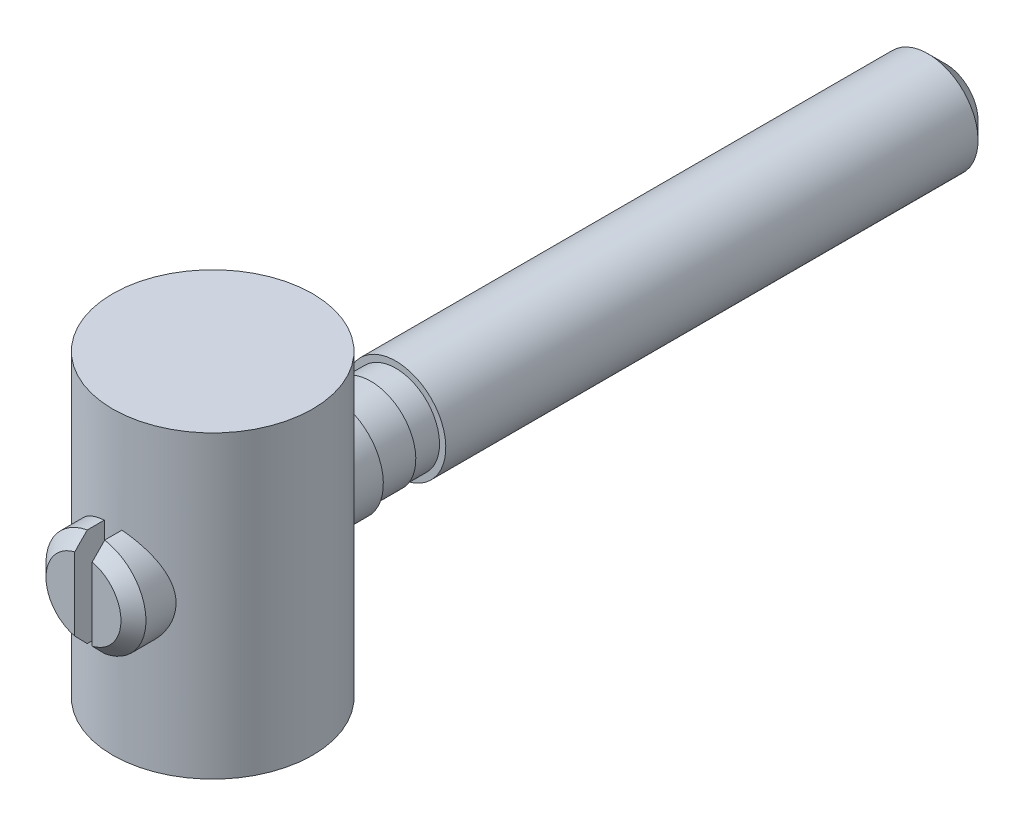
ISO-10303-21;
HEADER;
FILE_DESCRIPTION(('STEP AP214'),'2;1');
FILE_NAME('part.step','',(''),(''),'','','');
FILE_SCHEMA(('AUTOMOTIVE_DESIGN { 1 0 10303 214 1 1 1 1 }'));
ENDSEC;
DATA;
#1=APPLICATION_CONTEXT('core data for automotive mechanical design processes');
#2=APPLICATION_PROTOCOL_DEFINITION('international standard','automotive_design',2000,#1);
#3=PRODUCT_CONTEXT('',#1,'mechanical');
#4=PRODUCT('Part','Part','',(#3));
#5=PRODUCT_RELATED_PRODUCT_CATEGORY('part','',(#4));
#6=PRODUCT_DEFINITION_FORMATION('','',#4);
#7=PRODUCT_DEFINITION_CONTEXT('part definition',#1,'design');
#8=PRODUCT_DEFINITION('design','',#6,#7);
#9=PRODUCT_DEFINITION_SHAPE('','',#8);
#10=(LENGTH_UNIT() NAMED_UNIT(*) SI_UNIT(.MILLI.,.METRE.));
#11=(NAMED_UNIT(*) PLANE_ANGLE_UNIT() SI_UNIT($,.RADIAN.));
#12=(NAMED_UNIT(*) SI_UNIT($,.STERADIAN.) SOLID_ANGLE_UNIT());
#13=UNCERTAINTY_MEASURE_WITH_UNIT(LENGTH_MEASURE(1.E-05),#10,'distance_accuracy_value','');
#14=(GEOMETRIC_REPRESENTATION_CONTEXT(3) GLOBAL_UNCERTAINTY_ASSIGNED_CONTEXT((#13)) GLOBAL_UNIT_ASSIGNED_CONTEXT((#10,
#11,#12)) REPRESENTATION_CONTEXT('',''));
#15=CARTESIAN_POINT('',(0.,0.,0.));
#16=DIRECTION('',(0.,0.,1.));
#17=DIRECTION('',(1.,0.,0.));
#18=AXIS2_PLACEMENT_3D('',#15,#16,#17);
#19=CARTESIAN_POINT('',(0.,-6.,0.));
#20=DIRECTION('',(0.,-1.,0.));
#21=DIRECTION('',(1.,0.,0.));
#22=AXIS2_PLACEMENT_3D('',#19,#20,#21);
#23=PLANE('',#22);
#24=DIRECTION('',(0.5,0.,-0.866025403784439));
#25=VECTOR('',#24,1.);
#26=CARTESIAN_POINT('',(0.86602540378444,-6.,0.));
#27=LINE('',#26,#25);
#28=CARTESIAN_POINT('',(0.433012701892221,-6.,0.75));
#29=VERTEX_POINT('',#28);
#30=CARTESIAN_POINT('',(0.86602540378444,-6.,0.));
#31=VERTEX_POINT('',#30);
#32=EDGE_CURVE('E94',#29,#31,#27,.T.);
#33=ORIENTED_EDGE('',*,*,#32,.F.);
#34=DIRECTION('',(1.,0.,0.));
#35=VECTOR('',#34,1.);
#36=CARTESIAN_POINT('',(0.43301270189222,-6.,0.75));
#37=LINE('',#36,#35);
#38=CARTESIAN_POINT('',(-0.433012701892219,-6.,0.75));
#39=VERTEX_POINT('',#38);
#40=EDGE_CURVE('E92',#39,#29,#37,.T.);
#41=ORIENTED_EDGE('',*,*,#40,.F.);
#42=DIRECTION('',(0.5,0.,0.866025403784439));
#43=VECTOR('',#42,1.);
#44=CARTESIAN_POINT('',(-0.433012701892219,-6.,0.75));
#45=LINE('',#44,#43);
#46=CARTESIAN_POINT('',(-0.866025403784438,-6.,0.));
#47=VERTEX_POINT('',#46);
#48=EDGE_CURVE('E524',#47,#39,#45,.T.);
#49=ORIENTED_EDGE('',*,*,#48,.F.);
#50=DIRECTION('',(-0.5,0.,0.866025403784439));
#51=VECTOR('',#50,1.);
#52=CARTESIAN_POINT('',(-0.866025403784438,-6.,0.));
#53=LINE('',#52,#51);
#54=CARTESIAN_POINT('',(-0.433012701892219,-6.,-0.75));
#55=VERTEX_POINT('',#54);
#56=EDGE_CURVE('E574',#55,#47,#53,.T.);
#57=ORIENTED_EDGE('',*,*,#56,.F.);
#58=DIRECTION('',(-1.,0.,0.));
#59=VECTOR('',#58,1.);
#60=CARTESIAN_POINT('',(-0.433012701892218,-6.,-0.75));
#61=LINE('',#60,#59);
#62=CARTESIAN_POINT('',(0.433012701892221,-6.,-0.75));
#63=VERTEX_POINT('',#62);
#64=EDGE_CURVE('E535',#63,#55,#61,.T.);
#65=ORIENTED_EDGE('',*,*,#64,.F.);
#66=DIRECTION('',(-0.5,0.,-0.866025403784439));
#67=VECTOR('',#66,1.);
#68=CARTESIAN_POINT('',(0.433012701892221,-6.,-0.75));
#69=LINE('',#68,#67);
#70=EDGE_CURVE('E522',#31,#63,#69,.T.);
#71=ORIENTED_EDGE('',*,*,#70,.F.);
#72=EDGE_LOOP('',(#33,#41,#49,#57,#65,#71));
#73=FACE_BOUND('',#72,.T.);
#74=ADVANCED_FACE('F14',(#73),#23,.T.);
#75=CARTESIAN_POINT('',(0.433012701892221,-5.8,-0.75));
#76=DIRECTION('',(0.866025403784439,0.,-0.5));
#77=DIRECTION('',(-0.5,0.,-0.866025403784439));
#78=AXIS2_PLACEMENT_3D('',#75,#76,#77);
#79=PLANE('',#78);
#80=DIRECTION('',(0.,1.,0.));
#81=VECTOR('',#80,1.);
#82=CARTESIAN_POINT('',(0.86602540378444,-5.8,0.));
#83=LINE('',#82,#81);
#84=CARTESIAN_POINT('',(0.86602540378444,-7.,0.));
#85=VERTEX_POINT('',#84);
#86=EDGE_CURVE('E80',#31,#85,#83,.F.);
#87=ORIENTED_EDGE('',*,*,#86,.F.);
#88=ORIENTED_EDGE('',*,*,#70,.T.);
#89=DIRECTION('',(0.,1.,0.));
#90=VECTOR('',#89,1.);
#91=CARTESIAN_POINT('',(0.433012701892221,-5.8,-0.75));
#92=LINE('',#91,#90);
#93=CARTESIAN_POINT('',(0.433012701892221,-7.,-0.75));
#94=VERTEX_POINT('',#93);
#95=EDGE_CURVE('E107',#94,#63,#92,.T.);
#96=ORIENTED_EDGE('',*,*,#95,.F.);
#97=DIRECTION('',(0.5,0.,0.866025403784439));
#98=VECTOR('',#97,1.);
#99=CARTESIAN_POINT('',(0.43301270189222,-7.,-0.75));
#100=LINE('',#99,#98);
#101=EDGE_CURVE('E130',#94,#85,#100,.T.);
#102=ORIENTED_EDGE('',*,*,#101,.T.);
#103=EDGE_LOOP('',(#87,#88,#96,#102));
#104=FACE_BOUND('',#103,.T.);
#105=ADVANCED_FACE('F165',(#104),#79,.F.);
#106=CARTESIAN_POINT('',(0.86602540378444,-5.8,0.));
#107=DIRECTION('',(0.866025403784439,0.,0.5));
#108=DIRECTION('',(0.5,0.,-0.866025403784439));
#109=AXIS2_PLACEMENT_3D('',#106,#107,#108);
#110=PLANE('',#109);
#111=DIRECTION('',(0.,1.,0.));
#112=VECTOR('',#111,1.);
#113=CARTESIAN_POINT('',(0.43301270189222,-5.8,0.75));
#114=LINE('',#113,#112);
#115=CARTESIAN_POINT('',(0.43301270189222,-7.,0.75));
#116=VERTEX_POINT('',#115);
#117=EDGE_CURVE('E78',#116,#29,#114,.T.);
#118=ORIENTED_EDGE('',*,*,#117,.T.);
#119=ORIENTED_EDGE('',*,*,#32,.T.);
#120=ORIENTED_EDGE('',*,*,#86,.T.);
#121=DIRECTION('',(-0.5,0.,0.866025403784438));
#122=VECTOR('',#121,1.);
#123=CARTESIAN_POINT('',(0.86602540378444,-7.,0.));
#124=LINE('',#123,#122);
#125=EDGE_CURVE('E75',#85,#116,#124,.T.);
#126=ORIENTED_EDGE('',*,*,#125,.T.);
#127=EDGE_LOOP('',(#118,#119,#120,#126));
#128=FACE_BOUND('',#127,.T.);
#129=ADVANCED_FACE('F16',(#128),#110,.F.);
#130=CARTESIAN_POINT('',(0.43301270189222,-5.8,0.75));
#131=DIRECTION('',(0.,0.,1.));
#132=DIRECTION('',(1.,0.,0.));
#133=AXIS2_PLACEMENT_3D('',#130,#131,#132);
#134=PLANE('',#133);
#135=DIRECTION('',(0.,1.,0.));
#136=VECTOR('',#135,1.);
#137=CARTESIAN_POINT('',(-0.433012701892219,-5.8,0.75));
#138=LINE('',#137,#136);
#139=CARTESIAN_POINT('',(-0.433012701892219,-7.,0.75));
#140=VERTEX_POINT('',#139);
#141=EDGE_CURVE('E93',#140,#39,#138,.T.);
#142=ORIENTED_EDGE('',*,*,#141,.T.);
#143=ORIENTED_EDGE('',*,*,#40,.T.);
#144=ORIENTED_EDGE('',*,*,#117,.F.);
#145=DIRECTION('',(-1.,0.,0.));
#146=VECTOR('',#145,1.);
#147=CARTESIAN_POINT('',(0.,-7.,0.75));
#148=LINE('',#147,#146);
#149=EDGE_CURVE('E85',#116,#140,#148,.T.);
#150=ORIENTED_EDGE('',*,*,#149,.T.);
#151=EDGE_LOOP('',(#142,#143,#144,#150));
#152=FACE_BOUND('',#151,.T.);
#153=ADVANCED_FACE('F90',(#152),#134,.F.);
#154=CARTESIAN_POINT('',(-0.433012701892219,-5.8,0.75));
#155=DIRECTION('',(-0.866025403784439,0.,0.5));
#156=DIRECTION('',(0.5,0.,0.866025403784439));
#157=AXIS2_PLACEMENT_3D('',#154,#155,#156);
#158=PLANE('',#157);
#159=DIRECTION('',(0.,1.,0.));
#160=VECTOR('',#159,1.);
#161=CARTESIAN_POINT('',(-0.866025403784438,-5.8,0.));
#162=LINE('',#161,#160);
#163=CARTESIAN_POINT('',(-0.866025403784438,-7.,0.));
#164=VERTEX_POINT('',#163);
#165=EDGE_CURVE('E113',#164,#47,#162,.T.);
#166=ORIENTED_EDGE('',*,*,#165,.T.);
#167=ORIENTED_EDGE('',*,*,#48,.T.);
#168=ORIENTED_EDGE('',*,*,#141,.F.);
#169=DIRECTION('',(-0.5,0.,-0.866025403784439));
#170=VECTOR('',#169,1.);
#171=CARTESIAN_POINT('',(-0.43301270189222,-7.,0.75));
#172=LINE('',#171,#170);
#173=EDGE_CURVE('E100',#140,#164,#172,.T.);
#174=ORIENTED_EDGE('',*,*,#173,.T.);
#175=EDGE_LOOP('',(#166,#167,#168,#174));
#176=FACE_BOUND('',#175,.T.);
#177=ADVANCED_FACE('F175',(#176),#158,.F.);
#178=CARTESIAN_POINT('',(-0.866025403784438,-5.8,0.));
#179=DIRECTION('',(-0.866025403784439,0.,-0.5));
#180=DIRECTION('',(-0.5,0.,0.866025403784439));
#181=AXIS2_PLACEMENT_3D('',#178,#179,#180);
#182=PLANE('',#181);
#183=DIRECTION('',(0.,1.,0.));
#184=VECTOR('',#183,1.);
#185=CARTESIAN_POINT('',(-0.433012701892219,-5.8,-0.75));
#186=LINE('',#185,#184);
#187=CARTESIAN_POINT('',(-0.433012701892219,-7.,-0.75));
#188=VERTEX_POINT('',#187);
#189=EDGE_CURVE('E110',#188,#55,#186,.T.);
#190=ORIENTED_EDGE('',*,*,#189,.T.);
#191=ORIENTED_EDGE('',*,*,#56,.T.);
#192=ORIENTED_EDGE('',*,*,#165,.F.);
#193=DIRECTION('',(0.5,0.,-0.866025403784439));
#194=VECTOR('',#193,1.);
#195=CARTESIAN_POINT('',(-0.866025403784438,-7.,0.));
#196=LINE('',#195,#194);
#197=EDGE_CURVE('E102',#164,#188,#196,.T.);
#198=ORIENTED_EDGE('',*,*,#197,.T.);
#199=EDGE_LOOP('',(#190,#191,#192,#198));
#200=FACE_BOUND('',#199,.T.);
#201=ADVANCED_FACE('F171',(#200),#182,.F.);
#202=CARTESIAN_POINT('',(-0.433012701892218,-5.8,-0.75));
#203=DIRECTION('',(0.,0.,-1.));
#204=DIRECTION('',(-1.,0.,0.));
#205=AXIS2_PLACEMENT_3D('',#202,#203,#204);
#206=PLANE('',#205);
#207=ORIENTED_EDGE('',*,*,#95,.T.);
#208=ORIENTED_EDGE('',*,*,#64,.T.);
#209=ORIENTED_EDGE('',*,*,#189,.F.);
#210=DIRECTION('',(-1.,0.,0.));
#211=VECTOR('',#210,1.);
#212=CARTESIAN_POINT('',(0.,-7.,-0.75));
#213=LINE('',#212,#211);
#214=EDGE_CURVE('E529',#188,#94,#213,.F.);
#215=ORIENTED_EDGE('',*,*,#214,.T.);
#216=EDGE_LOOP('',(#207,#208,#209,#215));
#217=FACE_BOUND('',#216,.T.);
#218=ADVANCED_FACE('F163',(#217),#206,.F.);
#219=CARTESIAN_POINT('',(0.,-7.,0.));
#220=DIRECTION('',(0.,1.,0.));
#221=DIRECTION('',(-1.,0.,0.));
#222=AXIS2_PLACEMENT_3D('',#219,#220,#221);
#223=PLANE('',#222);
#224=CARTESIAN_POINT('',(0.,-7.,0.));
#225=DIRECTION('',(0.,1.,0.));
#226=DIRECTION('',(-1.,0.,0.));
#227=AXIS2_PLACEMENT_3D('',#224,#225,#226);
#228=CIRCLE('',#227,1.5);
#229=CARTESIAN_POINT('',(-1.5,-7.,0.));
#230=VERTEX_POINT('',#229);
#231=EDGE_CURVE('E127',#230,#230,#228,.T.);
#232=ORIENTED_EDGE('',*,*,#231,.F.);
#233=EDGE_LOOP('',(#232));
#234=FACE_BOUND('',#233,.T.);
#235=ORIENTED_EDGE('',*,*,#214,.F.);
#236=ORIENTED_EDGE('',*,*,#197,.F.);
#237=ORIENTED_EDGE('',*,*,#173,.F.);
#238=ORIENTED_EDGE('',*,*,#149,.F.);
#239=ORIENTED_EDGE('',*,*,#125,.F.);
#240=ORIENTED_EDGE('',*,*,#101,.F.);
#241=EDGE_LOOP('',(#235,#236,#237,#238,#239,#240));
#242=FACE_BOUND('',#241,.T.);
#243=ADVANCED_FACE('F98',(#234,#242),#223,.F.);
#244=CARTESIAN_POINT('',(0.,-4.,0.));
#245=DIRECTION('',(0.,1.,0.));
#246=DIRECTION('',(-1.,0.,0.));
#247=AXIS2_PLACEMENT_3D('',#244,#245,#246);
#248=CYLINDRICAL_SURFACE('',#247,1.5);
#249=ORIENTED_EDGE('',*,*,#231,.T.);
#250=EDGE_LOOP('',(#249));
#251=FACE_BOUND('',#250,.T.);
#252=CARTESIAN_POINT('',(0.,-6.,0.));
#253=DIRECTION('',(0.,1.,0.));
#254=DIRECTION('',(-1.,0.,0.));
#255=AXIS2_PLACEMENT_3D('',#252,#253,#254);
#256=CIRCLE('',#255,1.5);
#257=CARTESIAN_POINT('',(-1.5,-6.,0.));
#258=VERTEX_POINT('',#257);
#259=EDGE_CURVE('E124',#258,#258,#256,.F.);
#260=ORIENTED_EDGE('',*,*,#259,.T.);
#261=EDGE_LOOP('',(#260));
#262=FACE_BOUND('',#261,.T.);
#263=ADVANCED_FACE('F156',(#251,#262),#248,.T.);
#264=CARTESIAN_POINT('',(0.,6.,0.));
#265=DIRECTION('',(0.,1.,0.));
#266=DIRECTION('',(-1.,0.,0.));
#267=AXIS2_PLACEMENT_3D('',#264,#265,#266);
#268=PLANE('',#267);
#269=CARTESIAN_POINT('',(0.,6.,0.));
#270=DIRECTION('',(0.,-1.,0.));
#271=DIRECTION('',(1.,0.,0.));
#272=AXIS2_PLACEMENT_3D('',#269,#270,#271);
#273=CIRCLE('',#272,4.);
#274=CARTESIAN_POINT('',(4.,6.,0.));
#275=VERTEX_POINT('',#274);
#276=EDGE_CURVE('E121',#275,#275,#273,.T.);
#277=ORIENTED_EDGE('',*,*,#276,.F.);
#278=EDGE_LOOP('',(#277));
#279=FACE_BOUND('',#278,.T.);
#280=ADVANCED_FACE('F152',(#279),#268,.T.);
#281=CARTESIAN_POINT('',(0.,-6.,0.));
#282=DIRECTION('',(0.,1.,0.));
#283=DIRECTION('',(-1.,0.,0.));
#284=AXIS2_PLACEMENT_3D('',#281,#282,#283);
#285=PLANE('',#284);
#286=ORIENTED_EDGE('',*,*,#259,.F.);
#287=EDGE_LOOP('',(#286));
#288=FACE_BOUND('',#287,.T.);
#289=CARTESIAN_POINT('',(0.,-6.,0.));
#290=DIRECTION('',(0.,-1.,0.));
#291=DIRECTION('',(1.,0.,0.));
#292=AXIS2_PLACEMENT_3D('',#289,#290,#291);
#293=CIRCLE('',#292,4.);
#294=CARTESIAN_POINT('',(4.,-6.,0.));
#295=VERTEX_POINT('',#294);
#296=EDGE_CURVE('E117',#295,#295,#293,.F.);
#297=ORIENTED_EDGE('',*,*,#296,.F.);
#298=EDGE_LOOP('',(#297));
#299=FACE_BOUND('',#298,.T.);
#300=ADVANCED_FACE('F146',(#288,#299),#285,.F.);
#301=CARTESIAN_POINT('',(0.,6.,0.));
#302=DIRECTION('',(0.,-1.,0.));
#303=DIRECTION('',(1.,0.,0.));
#304=AXIS2_PLACEMENT_3D('',#301,#302,#303);
#305=CYLINDRICAL_SURFACE('',#304,4.);
#306=CARTESIAN_POINT('',(0.,-2.,4.));
#307=CARTESIAN_POINT('',(0.105143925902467,-1.99999339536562,3.99999426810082));
#308=CARTESIAN_POINT('',(0.210413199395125,-1.99165985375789,3.99580982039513));
#309=CARTESIAN_POINT('',(0.417840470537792,-1.95869423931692,3.97948312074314));
#310=CARTESIAN_POINT('',(0.519992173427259,-1.93403121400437,3.96732575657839));
#311=CARTESIAN_POINT('',(0.717867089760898,-1.86961238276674,3.9363255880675));
#312=CARTESIAN_POINT('',(0.813613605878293,-1.82991523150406,3.91750878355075));
#313=CARTESIAN_POINT('',(0.996945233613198,-1.73685875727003,3.87491553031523));
#314=CARTESIAN_POINT('',(1.08453098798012,-1.68350051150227,3.8511394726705));
#315=CARTESIAN_POINT('',(1.25501563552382,-1.56096550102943,3.79912516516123));
#316=CARTESIAN_POINT('',(1.33731042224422,-1.49102704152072,3.77070398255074));
#317=CARTESIAN_POINT('',(1.48955888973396,-1.33895704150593,3.71319940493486));
#318=CARTESIAN_POINT('',(1.55950316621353,-1.25681629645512,3.68411552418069));
#319=CARTESIAN_POINT('',(1.69050400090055,-1.07503330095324,3.62597902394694));
#320=CARTESIAN_POINT('',(1.75045067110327,-0.974527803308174,3.59710373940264));
#321=CARTESIAN_POINT('',(1.85233645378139,-0.76326532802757,3.54571957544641));
#322=CARTESIAN_POINT('',(1.89428842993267,-0.652515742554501,3.52320615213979));
#323=CARTESIAN_POINT('',(1.95626488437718,-0.430669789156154,3.48915734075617));
#324=CARTESIAN_POINT('',(1.97745171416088,-0.319991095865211,3.47704543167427));
#325=CARTESIAN_POINT('',(2.00085398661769,-0.0960423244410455,3.46363779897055));
#326=CARTESIAN_POINT('',(2.00308817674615,0.0172250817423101,3.46233138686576));
#327=CARTESIAN_POINT('',(1.98937457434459,0.228572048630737,3.47021860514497));
#328=CARTESIAN_POINT('',(1.97556911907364,0.326848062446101,3.47817527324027));
#329=CARTESIAN_POINT('',(1.93387969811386,0.519443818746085,3.50152457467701));
#330=CARTESIAN_POINT('',(1.9059912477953,0.613762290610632,3.51691957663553));
#331=CARTESIAN_POINT('',(1.83641956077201,0.798458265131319,3.55374952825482));
#332=CARTESIAN_POINT('',(1.79443013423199,0.888692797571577,3.57531681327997));
#333=CARTESIAN_POINT('',(1.698083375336,1.06126858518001,3.62206808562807));
#334=CARTESIAN_POINT('',(1.64372048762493,1.14360627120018,3.64725369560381));
#335=CARTESIAN_POINT('',(1.51613210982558,1.30904250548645,3.70226315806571));
#336=CARTESIAN_POINT('',(1.44138891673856,1.39091374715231,3.73227020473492));
#337=CARTESIAN_POINT('',(1.27911115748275,1.5414708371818,3.79095246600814));
#338=CARTESIAN_POINT('',(1.19157051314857,1.61015038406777,3.81962703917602));
#339=CARTESIAN_POINT('',(1.0010330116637,1.73537132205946,3.87403974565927));
#340=CARTESIAN_POINT('',(0.897507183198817,1.79120094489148,3.89957968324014));
#341=CARTESIAN_POINT('',(0.680932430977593,1.88419405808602,3.94315762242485));
#342=CARTESIAN_POINT('',(0.567891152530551,1.92137237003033,3.96120157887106));
#343=CARTESIAN_POINT('',(0.345532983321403,1.97295080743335,3.98648667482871));
#344=CARTESIAN_POINT('',(0.236683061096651,1.98898247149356,3.9944987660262));
#345=CARTESIAN_POINT('',(0.0175591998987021,2.00292946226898,4.00146026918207));
#346=CARTESIAN_POINT('',(-0.0927140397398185,2.00085337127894,4.00041397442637));
#347=CARTESIAN_POINT('',(-0.302465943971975,1.97958662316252,3.9898238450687));
#348=CARTESIAN_POINT('',(-0.402118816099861,1.96173493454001,3.98094491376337));
#349=CARTESIAN_POINT('',(-0.596813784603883,1.91152385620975,3.9564434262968));
#350=CARTESIAN_POINT('',(-0.691855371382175,1.87916286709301,3.94082012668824));
#351=CARTESIAN_POINT('',(-0.877777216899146,1.80000306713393,3.90368502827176));
#352=CARTESIAN_POINT('',(-0.968460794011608,1.75281789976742,3.88201763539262));
#353=CARTESIAN_POINT('',(-1.14092272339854,1.64578492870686,3.83487948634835));
#354=CARTESIAN_POINT('',(-1.22269725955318,1.58593173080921,3.80940711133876));
#355=CARTESIAN_POINT('',(-1.38353537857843,1.44847914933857,3.75416442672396));
#356=CARTESIAN_POINT('',(-1.46154415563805,1.3697142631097,3.72421769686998));
#357=CARTESIAN_POINT('',(-1.60371264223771,1.20014969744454,3.6652478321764));
#358=CARTESIAN_POINT('',(-1.66786277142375,1.10934176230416,3.63622534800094));
#359=CARTESIAN_POINT('',(-1.78341582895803,0.912712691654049,3.58102384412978));
#360=CARTESIAN_POINT('',(-1.8340509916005,0.806377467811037,3.55505059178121));
#361=CARTESIAN_POINT('',(-1.91616565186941,0.584979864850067,3.51148144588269));
#362=CARTESIAN_POINT('',(-1.94766983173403,0.469928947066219,3.493874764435));
#363=CARTESIAN_POINT('',(-1.98772337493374,0.24617955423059,3.47123002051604));
#364=CARTESIAN_POINT('',(-1.9981859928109,0.137931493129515,3.4651476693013));
#365=CARTESIAN_POINT('',(-2.0013783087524,-0.0788941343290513,3.46330709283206));
#366=CARTESIAN_POINT('',(-1.99411569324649,-0.187471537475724,3.4675443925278));
#367=CARTESIAN_POINT('',(-1.96385225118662,-0.390967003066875,3.48475724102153));
#368=CARTESIAN_POINT('',(-1.94241662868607,-0.486200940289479,3.49686188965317));
#369=CARTESIAN_POINT('',(-1.88635071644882,-0.671616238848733,3.52742032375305));
#370=CARTESIAN_POINT('',(-1.85171618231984,-0.761795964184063,3.54587615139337));
#371=CARTESIAN_POINT('',(-1.76763149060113,-0.941249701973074,3.58857060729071));
#372=CARTESIAN_POINT('',(-1.7173422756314,-1.03005580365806,3.61311444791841));
#373=CARTESIAN_POINT('',(-1.60430194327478,-1.19854907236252,3.66470663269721));
#374=CARTESIAN_POINT('',(-1.54154434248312,-1.27823146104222,3.69175627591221));
#375=CARTESIAN_POINT('',(-1.39640665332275,-1.43628396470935,3.74924646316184));
#376=CARTESIAN_POINT('',(-1.31256884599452,-1.51331820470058,3.77969966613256));
#377=CARTESIAN_POINT('',(-1.13230961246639,-1.65252596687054,3.83755504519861));
#378=CARTESIAN_POINT('',(-1.03588144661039,-1.71469147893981,3.8649555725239));
#379=CARTESIAN_POINT('',(-0.83186319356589,-1.82247272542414,3.91396019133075));
#380=CARTESIAN_POINT('',(-0.72419900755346,-1.86796833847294,3.93552192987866));
#381=CARTESIAN_POINT('',(-0.501484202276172,-1.93961633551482,3.97002682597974));
#382=CARTESIAN_POINT('',(-0.386455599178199,-1.96582369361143,3.98299446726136));
#383=CARTESIAN_POINT('',(-0.22520389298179,-1.98779482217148,3.99390923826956));
#384=CARTESIAN_POINT('',(-0.180323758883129,-1.99236528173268,3.99618730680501));
#385=CARTESIAN_POINT('',(-0.0903034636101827,-1.99846933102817,3.99923393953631));
#386=CARTESIAN_POINT('',(-0.0451632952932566,-2.00000283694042,4.00000246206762));
#387=CARTESIAN_POINT('',(0.,-2.,4.));
#388=B_SPLINE_CURVE_WITH_KNOTS('',3,(#306,#307,#308,#309,#310,#311,#312,#313,#314,#315,#316,
#317,#318,#319,#320,#321,#322,#323,#324,#325,#326,#327,#328,#329,#330,#331,#332,#333,#334,#335,
#336,#337,#338,#339,#340,#341,#342,#343,#344,#345,#346,#347,#348,#349,#350,#351,#352,#353,#354,
#355,#356,#357,#358,#359,#360,#361,#362,#363,#364,#365,#366,#367,#368,#369,#370,#371,#372,#373,
#374,#375,#376,#377,#378,#379,#380,#381,#382,#383,#384,#385,#386,#387),.UNSPECIFIED.,.T.,.F.,(4,
2,2,2,2,2,2,2,2,2,2,2,2,2,2,2,2,2,2,2,2,2,2,2,2,2,2,2,2,2,2,2,2,2,2,2,2,2,2,2,4),(0.,
0.315248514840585,0.631096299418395,0.945724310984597,1.26032752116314,1.59396351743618,
1.92785247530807,2.28763452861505,2.64715895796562,2.98516024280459,3.32282714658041,
3.62011424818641,3.91749607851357,4.22180480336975,4.52625042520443,4.86929882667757,
5.21251069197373,5.57166044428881,5.93052433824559,6.25966580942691,6.58865129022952,
6.89213813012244,7.19565843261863,7.50785712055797,7.82018901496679,8.16319221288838,
8.50643177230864,8.86629364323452,9.22569023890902,9.55058615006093,9.87534119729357,
10.1691586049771,10.463070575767,10.7767291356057,11.0905512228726,11.4425048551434,
11.7946476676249,12.1492802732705,12.502898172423,12.6383056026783,12.7737167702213),.UNSPECIFIED.);
#389=CARTESIAN_POINT('',(-0.35,1.96913686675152,3.98465807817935));
#390=VERTEX_POINT('',#389);
#391=CARTESIAN_POINT('',(-0.35,-1.96913686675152,3.98465807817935));
#392=VERTEX_POINT('',#391);
#393=EDGE_CURVE('E35',#390,#392,#388,.T.);
#394=ORIENTED_EDGE('',*,*,#393,.F.);
#395=DIRECTION('',(0.,-1.,0.));
#396=VECTOR('',#395,1.);
#397=CARTESIAN_POINT('',(-0.35,6.,3.98465807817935));
#398=LINE('',#397,#396);
#399=EDGE_CURVE('E135',#392,#390,#398,.F.);
#400=ORIENTED_EDGE('',*,*,#399,.F.);
#401=EDGE_LOOP('',(#394,#400));
#402=FACE_BOUND('',#401,.T.);
#403=ORIENTED_EDGE('',*,*,#296,.T.);
#404=EDGE_LOOP('',(#403));
#405=FACE_BOUND('',#404,.T.);
#406=ORIENTED_EDGE('',*,*,#276,.T.);
#407=EDGE_LOOP('',(#406));
#408=FACE_BOUND('',#407,.T.);
#409=CARTESIAN_POINT('',(0.35,-1.96913686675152,3.98465807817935));
#410=VERTEX_POINT('',#409);
#411=CARTESIAN_POINT('',(0.35,1.96913686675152,3.98465807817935));
#412=VERTEX_POINT('',#411);
#413=EDGE_CURVE('E28',#410,#412,#388,.T.);
#414=ORIENTED_EDGE('',*,*,#413,.F.);
#415=DIRECTION('',(0.,-1.,0.));
#416=VECTOR('',#415,1.);
#417=CARTESIAN_POINT('',(0.35,6.,3.98465807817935));
#418=LINE('',#417,#416);
#419=EDGE_CURVE('E559',#412,#410,#418,.T.);
#420=ORIENTED_EDGE('',*,*,#419,.F.);
#421=EDGE_LOOP('',(#414,#420));
#422=FACE_BOUND('',#421,.T.);
#423=CARTESIAN_POINT('',(0.,-2.,-4.));
#424=CARTESIAN_POINT('',(-0.105143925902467,-1.99999339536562,-3.99999426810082));
#425=CARTESIAN_POINT('',(-0.210413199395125,-1.99165985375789,-3.99580982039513));
#426=CARTESIAN_POINT('',(-0.417840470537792,-1.95869423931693,-3.97948312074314));
#427=CARTESIAN_POINT('',(-0.51999217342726,-1.93403121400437,-3.9673257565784));
#428=CARTESIAN_POINT('',(-0.717867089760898,-1.86961238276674,-3.93632558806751));
#429=CARTESIAN_POINT('',(-0.813613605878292,-1.82991523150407,-3.91750878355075));
#430=CARTESIAN_POINT('',(-0.996945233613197,-1.73685875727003,-3.87491553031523));
#431=CARTESIAN_POINT('',(-1.08453098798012,-1.68350051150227,-3.85113947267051));
#432=CARTESIAN_POINT('',(-1.25501563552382,-1.56096550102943,-3.79912516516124));
#433=CARTESIAN_POINT('',(-1.33731042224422,-1.49102704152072,-3.77070398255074));
#434=CARTESIAN_POINT('',(-1.48955888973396,-1.33895704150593,-3.71319940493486));
#435=CARTESIAN_POINT('',(-1.55950316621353,-1.25681629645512,-3.6841155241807));
#436=CARTESIAN_POINT('',(-1.69050400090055,-1.07503330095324,-3.62597902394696));
#437=CARTESIAN_POINT('',(-1.75045067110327,-0.974527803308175,-3.59710373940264));
#438=CARTESIAN_POINT('',(-1.85233645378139,-0.763265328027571,-3.54571957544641));
#439=CARTESIAN_POINT('',(-1.89428842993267,-0.652515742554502,-3.52320615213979));
#440=CARTESIAN_POINT('',(-1.95626488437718,-0.430669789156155,-3.48915734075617));
#441=CARTESIAN_POINT('',(-1.97745171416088,-0.319991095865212,-3.47704543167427));
#442=CARTESIAN_POINT('',(-2.00085398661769,-0.0960423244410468,-3.46363779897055));
#443=CARTESIAN_POINT('',(-2.00308817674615,0.0172250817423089,-3.46233138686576));
#444=CARTESIAN_POINT('',(-1.98937457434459,0.228572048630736,-3.47021860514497));
#445=CARTESIAN_POINT('',(-1.97556911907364,0.3268480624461,-3.47817527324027));
#446=CARTESIAN_POINT('',(-1.93387969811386,0.519443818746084,-3.50152457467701));
#447=CARTESIAN_POINT('',(-1.9059912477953,0.613762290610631,-3.51691957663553));
#448=CARTESIAN_POINT('',(-1.83641956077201,0.798458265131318,-3.55374952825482));
#449=CARTESIAN_POINT('',(-1.79443013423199,0.888692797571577,-3.57531681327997));
#450=CARTESIAN_POINT('',(-1.698083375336,1.06126858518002,-3.62206808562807));
#451=CARTESIAN_POINT('',(-1.64372048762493,1.14360627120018,-3.64725369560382));
#452=CARTESIAN_POINT('',(-1.51613210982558,1.30904250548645,-3.70226315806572));
#453=CARTESIAN_POINT('',(-1.44138891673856,1.39091374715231,-3.73227020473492));
#454=CARTESIAN_POINT('',(-1.27911115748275,1.5414708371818,-3.79095246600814));
#455=CARTESIAN_POINT('',(-1.19157051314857,1.61015038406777,-3.81962703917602));
#456=CARTESIAN_POINT('',(-1.0010330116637,1.73537132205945,-3.87403974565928));
#457=CARTESIAN_POINT('',(-0.897507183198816,1.79120094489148,-3.89957968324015));
#458=CARTESIAN_POINT('',(-0.680932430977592,1.88419405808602,-3.94315762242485));
#459=CARTESIAN_POINT('',(-0.567891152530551,1.92137237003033,-3.96120157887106));
#460=CARTESIAN_POINT('',(-0.345532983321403,1.97295080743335,-3.98648667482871));
#461=CARTESIAN_POINT('',(-0.236683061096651,1.98898247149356,-3.9944987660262));
#462=CARTESIAN_POINT('',(-0.0175591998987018,2.00292946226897,-4.00146026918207));
#463=CARTESIAN_POINT('',(0.0927140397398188,2.00085337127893,-4.00041397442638));
#464=CARTESIAN_POINT('',(0.302465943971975,1.97958662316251,-3.9898238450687));
#465=CARTESIAN_POINT('',(0.402118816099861,1.96173493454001,-3.98094491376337));
#466=CARTESIAN_POINT('',(0.596813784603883,1.91152385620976,-3.95644342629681));
#467=CARTESIAN_POINT('',(0.691855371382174,1.87916286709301,-3.94082012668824));
#468=CARTESIAN_POINT('',(0.877777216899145,1.80000306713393,-3.90368502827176));
#469=CARTESIAN_POINT('',(0.968460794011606,1.75281789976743,-3.88201763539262));
#470=CARTESIAN_POINT('',(1.14092272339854,1.64578492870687,-3.83487948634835));
#471=CARTESIAN_POINT('',(1.22269725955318,1.58593173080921,-3.80940711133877));
#472=CARTESIAN_POINT('',(1.38353537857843,1.44847914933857,-3.75416442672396));
#473=CARTESIAN_POINT('',(1.46154415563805,1.36971426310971,-3.72421769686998));
#474=CARTESIAN_POINT('',(1.60371264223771,1.20014969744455,-3.6652478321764));
#475=CARTESIAN_POINT('',(1.66786277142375,1.10934176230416,-3.63622534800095));
#476=CARTESIAN_POINT('',(1.78341582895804,0.912712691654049,-3.58102384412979));
#477=CARTESIAN_POINT('',(1.8340509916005,0.806377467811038,-3.55505059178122));
#478=CARTESIAN_POINT('',(1.91616565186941,0.584979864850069,-3.51148144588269));
#479=CARTESIAN_POINT('',(1.94766983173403,0.46992894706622,-3.493874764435));
#480=CARTESIAN_POINT('',(1.98772337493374,0.24617955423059,-3.47123002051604));
#481=CARTESIAN_POINT('',(1.9981859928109,0.137931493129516,-3.4651476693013));
#482=CARTESIAN_POINT('',(2.00137830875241,-0.0788941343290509,-3.46330709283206));
#483=CARTESIAN_POINT('',(1.99411569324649,-0.187471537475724,-3.4675443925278));
#484=CARTESIAN_POINT('',(1.96385225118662,-0.390967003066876,-3.48475724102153));
#485=CARTESIAN_POINT('',(1.94241662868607,-0.486200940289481,-3.49686188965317));
#486=CARTESIAN_POINT('',(1.88635071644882,-0.671616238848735,-3.52742032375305));
#487=CARTESIAN_POINT('',(1.85171618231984,-0.761795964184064,-3.54587615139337));
#488=CARTESIAN_POINT('',(1.76763149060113,-0.941249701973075,-3.58857060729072));
#489=CARTESIAN_POINT('',(1.7173422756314,-1.03005580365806,-3.61311444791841));
#490=CARTESIAN_POINT('',(1.60430194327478,-1.19854907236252,-3.66470663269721));
#491=CARTESIAN_POINT('',(1.54154434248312,-1.27823146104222,-3.69175627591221));
#492=CARTESIAN_POINT('',(1.39640665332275,-1.43628396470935,-3.74924646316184));
#493=CARTESIAN_POINT('',(1.31256884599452,-1.51331820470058,-3.77969966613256));
#494=CARTESIAN_POINT('',(1.13230961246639,-1.65252596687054,-3.83755504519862));
#495=CARTESIAN_POINT('',(1.03588144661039,-1.71469147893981,-3.86495557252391));
#496=CARTESIAN_POINT('',(0.83186319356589,-1.82247272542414,-3.91396019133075));
#497=CARTESIAN_POINT('',(0.72419900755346,-1.86796833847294,-3.93552192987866));
#498=CARTESIAN_POINT('',(0.501484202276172,-1.93961633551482,-3.97002682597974));
#499=CARTESIAN_POINT('',(0.386455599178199,-1.96582369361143,-3.98299446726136));
#500=CARTESIAN_POINT('',(0.22520389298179,-1.98779482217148,-3.99390923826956));
#501=CARTESIAN_POINT('',(0.18032375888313,-1.99236528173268,-3.99618730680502));
#502=CARTESIAN_POINT('',(0.0903034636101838,-1.99846933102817,-3.99923393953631));
#503=CARTESIAN_POINT('',(0.0451632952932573,-2.00000283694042,-4.00000246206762));
#504=CARTESIAN_POINT('',(0.,-2.,-4.));
#505=B_SPLINE_CURVE_WITH_KNOTS('',3,(#423,#424,#425,#426,#427,#428,#429,#430,#431,#432,#433,
#434,#435,#436,#437,#438,#439,#440,#441,#442,#443,#444,#445,#446,#447,#448,#449,#450,#451,#452,
#453,#454,#455,#456,#457,#458,#459,#460,#461,#462,#463,#464,#465,#466,#467,#468,#469,#470,#471,
#472,#473,#474,#475,#476,#477,#478,#479,#480,#481,#482,#483,#484,#485,#486,#487,#488,#489,#490,
#491,#492,#493,#494,#495,#496,#497,#498,#499,#500,#501,#502,#503,#504),.UNSPECIFIED.,.T.,.F.,(4,
2,2,2,2,2,2,2,2,2,2,2,2,2,2,2,2,2,2,2,2,2,2,2,2,2,2,2,2,2,2,2,2,2,2,2,2,2,2,2,4),(0.,
0.315248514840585,0.631096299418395,0.945724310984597,1.26032752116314,1.59396351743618,
1.92785247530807,2.28763452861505,2.64715895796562,2.98516024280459,3.32282714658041,
3.62011424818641,3.91749607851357,4.22180480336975,4.52625042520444,4.86929882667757,
5.21251069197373,5.57166044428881,5.93052433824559,6.25966580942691,6.58865129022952,
6.89213813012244,7.19565843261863,7.50785712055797,7.82018901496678,8.16319221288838,
8.50643177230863,8.86629364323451,9.22569023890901,9.55058615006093,9.87534119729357,
10.1691586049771,10.463070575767,10.7767291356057,11.0905512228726,11.4425048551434,
11.7946476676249,12.1492802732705,12.502898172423,12.6383056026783,12.7737167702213),.UNSPECIFIED.);
#506=CARTESIAN_POINT('',(0.,-2.,-4.));
#507=VERTEX_POINT('',#506);
#508=EDGE_CURVE('E9',#507,#507,#505,.T.);
#509=ORIENTED_EDGE('',*,*,#508,.F.);
#510=EDGE_LOOP('',(#509));
#511=FACE_BOUND('',#510,.T.);
#512=ADVANCED_FACE('F140',(#402,#405,#408,#422,#511),#305,.T.);
#513=CARTESIAN_POINT('',(0.,0.,5.17012492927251));
#514=DIRECTION('',(0.,0.,-1.));
#515=DIRECTION('',(0.,1.,0.));
#516=AXIS2_PLACEMENT_3D('',#513,#514,#515);
#517=PLANE('',#516);
#518=CARTESIAN_POINT('',(0.,0.,5.17012492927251));
#519=DIRECTION('',(0.,0.,-1.));
#520=DIRECTION('',(0.,1.,0.));
#521=AXIS2_PLACEMENT_3D('',#518,#519,#520);
#522=CIRCLE('',#521,1.5);
#523=CARTESIAN_POINT('',(0.35,-1.45859521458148,5.17012492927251));
#524=VERTEX_POINT('',#523);
#525=CARTESIAN_POINT('',(0.35,1.45859521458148,5.17012492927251));
#526=VERTEX_POINT('',#525);
#527=EDGE_CURVE('E218',#524,#526,#522,.F.);
#528=ORIENTED_EDGE('',*,*,#527,.T.);
#529=DIRECTION('',(0.,1.,0.));
#530=VECTOR('',#529,1.);
#531=CARTESIAN_POINT('',(0.35,1.96913686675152,5.17012492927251));
#532=LINE('',#531,#530);
#533=EDGE_CURVE('E120',#524,#526,#532,.T.);
#534=ORIENTED_EDGE('',*,*,#533,.F.);
#535=EDGE_LOOP('',(#528,#534));
#536=FACE_BOUND('',#535,.T.);
#537=ADVANCED_FACE('F145',(#536),#517,.F.);
#538=CARTESIAN_POINT('',(0.,0.,5.17012492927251));
#539=DIRECTION('',(0.,0.,-1.));
#540=DIRECTION('',(0.,1.,0.));
#541=AXIS2_PLACEMENT_3D('',#538,#539,#540);
#542=CONICAL_SURFACE('',#541,1.5,0.785398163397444);
#543=CARTESIAN_POINT('',(0.35,-4.35126885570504,2.30480241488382));
#544=CARTESIAN_POINT('',(0.350000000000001,-4.19641291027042,2.4591552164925));
#545=CARTESIAN_POINT('',(0.350000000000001,-4.04153476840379,2.61348578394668));
#546=CARTESIAN_POINT('',(0.350000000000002,-3.7316961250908,2.92207839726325));
#547=CARTESIAN_POINT('',(0.350000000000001,-3.57673562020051,3.07634043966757));
#548=CARTESIAN_POINT('',(0.350000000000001,-3.26653656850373,3.3849288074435));
#549=CARTESIAN_POINT('',(0.350000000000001,-3.111297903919,3.5392550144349));
#550=CARTESIAN_POINT('',(0.350000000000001,-2.80066386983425,3.84773590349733));
#551=CARTESIAN_POINT('',(0.350000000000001,-2.64526850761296,4.00189059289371));
#552=CARTESIAN_POINT('',(0.350000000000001,-2.34228144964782,4.30192668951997));
#553=CARTESIAN_POINT('',(0.350000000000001,-2.19470355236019,4.4478220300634));
#554=CARTESIAN_POINT('',(0.350000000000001,-1.89910586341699,4.73920311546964));
#555=CARTESIAN_POINT('',(0.350000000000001,-1.75108601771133,4.8846888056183));
#556=CARTESIAN_POINT('',(0.350000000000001,-1.52844687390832,5.10219422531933));
#557=CARTESIAN_POINT('',(0.350000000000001,-1.45415744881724,5.17455120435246));
#558=CARTESIAN_POINT('',(0.350000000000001,-1.30522725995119,5.31891029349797));
#559=CARTESIAN_POINT('',(0.350000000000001,-1.23058647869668,5.39091238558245));
#560=CARTESIAN_POINT('',(0.350000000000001,-1.08076094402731,5.53431637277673));
#561=CARTESIAN_POINT('',(0.350000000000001,-1.00557632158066,5.60571840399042));
#562=CARTESIAN_POINT('',(0.350000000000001,-0.892022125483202,5.71198570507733));
#563=CARTESIAN_POINT('',(0.350000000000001,-0.854042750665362,5.74726742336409));
#564=CARTESIAN_POINT('',(0.35,-0.777709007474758,5.81742229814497));
#565=CARTESIAN_POINT('',(0.35,-0.739354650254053,5.85229546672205));
#566=CARTESIAN_POINT('',(0.35,-0.679196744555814,5.90611126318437));
#567=CARTESIAN_POINT('',(0.350000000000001,-0.657585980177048,5.92526919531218));
#568=CARTESIAN_POINT('',(0.350000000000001,-0.614138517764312,5.96333222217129));
#569=CARTESIAN_POINT('',(0.350000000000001,-0.592301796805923,5.98223729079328));
#570=CARTESIAN_POINT('',(0.350000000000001,-0.548146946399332,6.01987082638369));
#571=CARTESIAN_POINT('',(0.350000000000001,-0.525826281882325,6.03859632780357));
#572=CARTESIAN_POINT('',(0.35,-0.48079769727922,6.07556550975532));
#573=CARTESIAN_POINT('',(0.35,-0.458089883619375,6.09380931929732));
#574=CARTESIAN_POINT('',(0.35,-0.411906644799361,6.12979649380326));
#575=CARTESIAN_POINT('',(0.35,-0.388425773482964,6.14753291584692));
#576=CARTESIAN_POINT('',(0.350000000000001,-0.340709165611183,6.18195596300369));
#577=CARTESIAN_POINT('',(0.350000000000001,-0.316473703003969,6.19864296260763));
#578=CARTESIAN_POINT('',(0.350000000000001,-0.267118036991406,6.23024564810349));
#579=CARTESIAN_POINT('',(0.350000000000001,-0.242006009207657,6.24517389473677));
#580=CARTESIAN_POINT('',(0.35,-0.190376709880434,6.27230332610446));
#581=CARTESIAN_POINT('',(0.35,-0.163863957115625,6.2845126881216));
#582=CARTESIAN_POINT('',(0.35,-0.115662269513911,6.3020158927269));
#583=CARTESIAN_POINT('',(0.35,-0.0943343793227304,6.30826506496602));
#584=CARTESIAN_POINT('',(0.35,-0.0509670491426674,6.31706349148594));
#585=CARTESIAN_POINT('',(0.35,-0.0289307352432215,6.31962719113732));
#586=CARTESIAN_POINT('',(0.35,0.0153473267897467,6.32049089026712));
#587=CARTESIAN_POINT('',(0.35,0.0375895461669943,6.31876844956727));
#588=CARTESIAN_POINT('',(0.35,0.0814521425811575,6.31143148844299));
#589=CARTESIAN_POINT('',(0.35,0.103070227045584,6.30580415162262));
#590=CARTESIAN_POINT('',(0.35,0.146000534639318,6.29145468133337));
#591=CARTESIAN_POINT('',(0.35,0.167279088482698,6.28263649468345));
#592=CARTESIAN_POINT('',(0.350000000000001,0.208879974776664,6.26294636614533));
#593=CARTESIAN_POINT('',(0.35,0.229200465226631,6.25207065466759));
#594=CARTESIAN_POINT('',(0.35,0.269207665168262,6.22887096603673));
#595=CARTESIAN_POINT('',(0.35,0.288887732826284,6.21653574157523));
#596=CARTESIAN_POINT('',(0.35,0.327605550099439,6.19094192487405));
#597=CARTESIAN_POINT('',(0.35,0.346643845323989,6.17768414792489));
#598=CARTESIAN_POINT('',(0.35,0.406445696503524,6.13451144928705));
#599=CARTESIAN_POINT('',(0.35,0.446338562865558,6.10339969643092));
#600=CARTESIAN_POINT('',(0.350000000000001,0.524892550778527,6.03964930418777));
#601=CARTESIAN_POINT('',(0.35,0.563552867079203,6.00700969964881));
#602=CARTESIAN_POINT('',(0.35,0.640169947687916,5.94077880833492));
#603=CARTESIAN_POINT('',(0.35,0.678125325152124,5.90718591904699));
#604=CARTESIAN_POINT('',(0.35,0.75351895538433,5.8394500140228));
#605=CARTESIAN_POINT('',(0.35,0.790957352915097,5.80530715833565));
#606=CARTESIAN_POINT('',(0.35,0.902510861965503,5.70256367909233));
#607=CARTESIAN_POINT('',(0.35,0.976123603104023,5.63341855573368));
#608=CARTESIAN_POINT('',(0.35,1.12257494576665,5.49447157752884));
#609=CARTESIAN_POINT('',(0.35,1.19541427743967,5.42467048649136));
#610=CARTESIAN_POINT('',(0.35,1.39829359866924,5.22912073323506));
#611=CARTESIAN_POINT('',(0.35,1.52788326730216,5.10290515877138));
#612=CARTESIAN_POINT('',(0.35,1.78647544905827,4.84987164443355));
#613=CARTESIAN_POINT('',(0.35,1.91547795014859,4.72305369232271));
#614=CARTESIAN_POINT('',(0.35,2.1732151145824,4.46901451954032));
#615=CARTESIAN_POINT('',(0.35,2.30194960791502,4.34179312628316));
#616=CARTESIAN_POINT('',(0.35,2.55921717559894,4.08714911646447));
#617=CARTESIAN_POINT('',(0.35,2.6877502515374,3.95972650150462));
#618=CARTESIAN_POINT('',(0.35,3.07247665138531,3.57794239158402));
#619=CARTESIAN_POINT('',(0.35,3.32848011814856,3.32338958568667));
#620=CARTESIAN_POINT('',(0.35,3.71223239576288,2.94144844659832));
#621=CARTESIAN_POINT('',(0.35,3.8400722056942,2.81415144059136));
#622=CARTESIAN_POINT('',(0.35,4.09570351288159,2.55950967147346));
#623=CARTESIAN_POINT('',(0.35,4.22349501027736,2.43216490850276));
#624=CARTESIAN_POINT('',(0.35,4.35126885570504,2.30480241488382));
#625=B_SPLINE_CURVE_WITH_KNOTS('',3,(#543,#544,#545,#546,#547,#548,#549,#550,#551,#552,#553,
#554,#555,#556,#557,#558,#559,#560,#561,#562,#563,#564,#565,#566,#567,#568,#569,#570,#571,#572,
#573,#574,#575,#576,#577,#578,#579,#580,#581,#582,#583,#584,#585,#586,#587,#588,#589,#590,#591,
#592,#593,#594,#595,#596,#597,#598,#599,#600,#601,#602,#603,#604,#605,#606,#607,#608,#609,#610,
#611,#612,#613,#614,#615,#616,#617,#618,#619,#620,#621,#622,#623,#624),.UNSPECIFIED.,.F.,.F.,(4,
2,2,2,2,2,2,2,2,2,2,2,2,2,2,2,2,2,2,2,2,2,2,2,2,2,2,2,2,2,2,2,2,2,2,2,2,2,2,2,4),(0.,
0.655931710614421,1.31189343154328,1.96858248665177,2.62524232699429,3.24780305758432,
3.87044333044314,4.1815534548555,4.49267922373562,4.80373240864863,4.95924629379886,
5.1147555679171,5.20139397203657,5.28804125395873,5.37544205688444,5.46281920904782,
5.5510816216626,5.63931235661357,5.7268688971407,5.8141584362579,5.88059131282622,
5.94676308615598,6.01328203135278,6.08002033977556,6.14896231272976,6.21803183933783,
6.28767333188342,6.3572540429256,6.50893272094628,6.66070854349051,6.812756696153,
6.96476137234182,7.26773191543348,7.57038509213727,8.11307078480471,8.65576754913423,
9.19874089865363,9.74170994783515,10.8247672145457,11.3659953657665,11.9072219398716),.UNSPECIFIED.);
#626=CARTESIAN_POINT('',(0.35,-1.96913686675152,4.6701249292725));
#627=VERTEX_POINT('',#626);
#628=EDGE_CURVE('E241',#627,#524,#625,.T.);
#629=ORIENTED_EDGE('',*,*,#628,.F.);
#630=CARTESIAN_POINT('',(0.,0.,4.6701249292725));
#631=DIRECTION('',(0.,0.,-1.));
#632=DIRECTION('',(0.,1.,0.));
#633=AXIS2_PLACEMENT_3D('',#630,#631,#632);
#634=CIRCLE('',#633,2.);
#635=CARTESIAN_POINT('',(0.35,1.96913686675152,4.6701249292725));
#636=VERTEX_POINT('',#635);
#637=EDGE_CURVE('E221',#636,#627,#634,.T.);
#638=ORIENTED_EDGE('',*,*,#637,.F.);
#639=EDGE_CURVE('E234',#526,#636,#625,.T.);
#640=ORIENTED_EDGE('',*,*,#639,.F.);
#641=ORIENTED_EDGE('',*,*,#527,.F.);
#642=EDGE_LOOP('',(#629,#638,#640,#641));
#643=FACE_BOUND('',#642,.T.);
#644=ADVANCED_FACE('F185',(#643),#542,.T.);
#645=CARTESIAN_POINT('',(0.,0.,35.4654908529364));
#646=DIRECTION('',(0.,0.,1.));
#647=DIRECTION('',(0.,-1.,0.));
#648=AXIS2_PLACEMENT_3D('',#645,#646,#647);
#649=CYLINDRICAL_SURFACE('',#648,2.);
#650=DIRECTION('',(0.,0.,1.));
#651=VECTOR('',#650,1.);
#652=CARTESIAN_POINT('',(0.35,-1.96913686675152,3.77012492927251));
#653=LINE('',#652,#651);
#654=EDGE_CURVE('E285',#410,#627,#653,.T.);
#655=ORIENTED_EDGE('',*,*,#654,.F.);
#656=ORIENTED_EDGE('',*,*,#413,.T.);
#657=DIRECTION('',(0.,0.,1.));
#658=VECTOR('',#657,1.);
#659=CARTESIAN_POINT('',(0.35,1.96913686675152,3.77012492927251));
#660=LINE('',#659,#658);
#661=EDGE_CURVE('E278',#412,#636,#660,.T.);
#662=ORIENTED_EDGE('',*,*,#661,.T.);
#663=ORIENTED_EDGE('',*,*,#637,.T.);
#664=EDGE_LOOP('',(#655,#656,#662,#663));
#665=FACE_BOUND('',#664,.T.);
#666=ADVANCED_FACE('F190',(#665),#649,.T.);
#667=CARTESIAN_POINT('',(0.35,1.96913686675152,3.77012492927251));
#668=DIRECTION('',(1.,0.,0.));
#669=DIRECTION('',(0.,1.,0.));
#670=AXIS2_PLACEMENT_3D('',#667,#668,#669);
#671=PLANE('',#670);
#672=ORIENTED_EDGE('',*,*,#661,.F.);
#673=ORIENTED_EDGE('',*,*,#419,.T.);
#674=ORIENTED_EDGE('',*,*,#654,.T.);
#675=ORIENTED_EDGE('',*,*,#628,.T.);
#676=ORIENTED_EDGE('',*,*,#533,.T.);
#677=ORIENTED_EDGE('',*,*,#639,.T.);
#678=EDGE_LOOP('',(#672,#673,#674,#675,#676,#677));
#679=FACE_BOUND('',#678,.T.);
#680=ADVANCED_FACE('F197',(#679),#671,.F.);
#681=CARTESIAN_POINT('',(-0.35,1.45859521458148,5.17012492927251));
#682=VERTEX_POINT('',#681);
#683=CARTESIAN_POINT('',(-0.35,-1.45859521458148,5.17012492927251));
#684=VERTEX_POINT('',#683);
#685=EDGE_CURVE('E209',#682,#684,#522,.F.);
#686=ORIENTED_EDGE('',*,*,#685,.T.);
#687=DIRECTION('',(0.,-1.,0.));
#688=VECTOR('',#687,1.);
#689=CARTESIAN_POINT('',(-0.35,1.96913686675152,5.17012492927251));
#690=LINE('',#689,#688);
#691=EDGE_CURVE('E212',#682,#684,#690,.T.);
#692=ORIENTED_EDGE('',*,*,#691,.F.);
#693=EDGE_LOOP('',(#686,#692));
#694=FACE_BOUND('',#693,.T.);
#695=ADVANCED_FACE('F147',(#694),#517,.F.);
#696=CARTESIAN_POINT('',(-0.35,4.35126885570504,2.30480241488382));
#697=CARTESIAN_POINT('',(-0.35,4.19641291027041,2.4591552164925));
#698=CARTESIAN_POINT('',(-0.35,4.04153476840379,2.61348578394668));
#699=CARTESIAN_POINT('',(-0.35,3.7316961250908,2.92207839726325));
#700=CARTESIAN_POINT('',(-0.35,3.57673562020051,3.07634043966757));
#701=CARTESIAN_POINT('',(-0.35,3.26653656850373,3.38492880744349));
#702=CARTESIAN_POINT('',(-0.35,3.111297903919,3.5392550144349));
#703=CARTESIAN_POINT('',(-0.35,2.80066386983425,3.84773590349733));
#704=CARTESIAN_POINT('',(-0.35,2.64526850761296,4.00189059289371));
#705=CARTESIAN_POINT('',(-0.35,2.34228144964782,4.30192668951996));
#706=CARTESIAN_POINT('',(-0.35,2.19470355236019,4.44782203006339));
#707=CARTESIAN_POINT('',(-0.35,1.899105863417,4.73920311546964));
#708=CARTESIAN_POINT('',(-0.35,1.75108601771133,4.8846888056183));
#709=CARTESIAN_POINT('',(-0.35,1.52844687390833,5.10219422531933));
#710=CARTESIAN_POINT('',(-0.35,1.45415744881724,5.17455120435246));
#711=CARTESIAN_POINT('',(-0.35,1.30522725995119,5.31891029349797));
#712=CARTESIAN_POINT('',(-0.35,1.23058647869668,5.39091238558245));
#713=CARTESIAN_POINT('',(-0.35,1.08076094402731,5.53431637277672));
#714=CARTESIAN_POINT('',(-0.35,1.00557632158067,5.60571840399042));
#715=CARTESIAN_POINT('',(-0.35,0.892022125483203,5.71198570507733));
#716=CARTESIAN_POINT('',(-0.35,0.854042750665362,5.74726742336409));
#717=CARTESIAN_POINT('',(-0.35,0.777709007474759,5.81742229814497));
#718=CARTESIAN_POINT('',(-0.35,0.739354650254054,5.85229546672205));
#719=CARTESIAN_POINT('',(-0.35,0.679196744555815,5.90611126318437));
#720=CARTESIAN_POINT('',(-0.35,0.657585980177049,5.92526919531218));
#721=CARTESIAN_POINT('',(-0.35,0.614138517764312,5.96333222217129));
#722=CARTESIAN_POINT('',(-0.35,0.592301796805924,5.98223729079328));
#723=CARTESIAN_POINT('',(-0.35,0.548146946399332,6.01987082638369));
#724=CARTESIAN_POINT('',(-0.35,0.525826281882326,6.03859632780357));
#725=CARTESIAN_POINT('',(-0.35,0.48079769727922,6.07556550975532));
#726=CARTESIAN_POINT('',(-0.35,0.458089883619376,6.09380931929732));
#727=CARTESIAN_POINT('',(-0.35,0.411906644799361,6.12979649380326));
#728=CARTESIAN_POINT('',(-0.35,0.388425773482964,6.14753291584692));
#729=CARTESIAN_POINT('',(-0.35,0.340709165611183,6.18195596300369));
#730=CARTESIAN_POINT('',(-0.35,0.316473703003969,6.19864296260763));
#731=CARTESIAN_POINT('',(-0.35,0.267118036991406,6.2302456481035));
#732=CARTESIAN_POINT('',(-0.35,0.242006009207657,6.24517389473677));
#733=CARTESIAN_POINT('',(-0.35,0.190376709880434,6.27230332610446));
#734=CARTESIAN_POINT('',(-0.35,0.163863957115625,6.2845126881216));
#735=CARTESIAN_POINT('',(-0.35,0.115662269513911,6.3020158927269));
#736=CARTESIAN_POINT('',(-0.35,0.0943343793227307,6.30826506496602));
#737=CARTESIAN_POINT('',(-0.35,0.0509670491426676,6.31706349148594));
#738=CARTESIAN_POINT('',(-0.35,0.0289307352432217,6.31962719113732));
#739=CARTESIAN_POINT('',(-0.35,-0.0153473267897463,6.32049089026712));
#740=CARTESIAN_POINT('',(-0.35,-0.0375895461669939,6.31876844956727));
#741=CARTESIAN_POINT('',(-0.35,-0.0814521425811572,6.31143148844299));
#742=CARTESIAN_POINT('',(-0.35,-0.103070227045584,6.30580415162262));
#743=CARTESIAN_POINT('',(-0.35,-0.146000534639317,6.29145468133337));
#744=CARTESIAN_POINT('',(-0.35,-0.167279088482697,6.28263649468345));
#745=CARTESIAN_POINT('',(-0.35,-0.208879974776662,6.26294636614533));
#746=CARTESIAN_POINT('',(-0.35,-0.22920046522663,6.25207065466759));
#747=CARTESIAN_POINT('',(-0.35,-0.269207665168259,6.22887096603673));
#748=CARTESIAN_POINT('',(-0.35,-0.28888773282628,6.21653574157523));
#749=CARTESIAN_POINT('',(-0.35,-0.327605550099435,6.19094192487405));
#750=CARTESIAN_POINT('',(-0.35,-0.346643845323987,6.1776841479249));
#751=CARTESIAN_POINT('',(-0.35,-0.406445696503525,6.13451144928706));
#752=CARTESIAN_POINT('',(-0.35,-0.446338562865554,6.10339969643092));
#753=CARTESIAN_POINT('',(-0.35,-0.52489255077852,6.03964930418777));
#754=CARTESIAN_POINT('',(-0.35,-0.563552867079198,6.00700969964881));
#755=CARTESIAN_POINT('',(-0.35,-0.640169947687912,5.94077880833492));
#756=CARTESIAN_POINT('',(-0.35,-0.678125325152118,5.90718591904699));
#757=CARTESIAN_POINT('',(-0.35,-0.753518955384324,5.83945001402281));
#758=CARTESIAN_POINT('',(-0.35,-0.790957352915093,5.80530715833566));
#759=CARTESIAN_POINT('',(-0.35,-0.9025108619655,5.70256367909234));
#760=CARTESIAN_POINT('',(-0.35,-0.97612360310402,5.63341855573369));
#761=CARTESIAN_POINT('',(-0.35,-1.12257494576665,5.49447157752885));
#762=CARTESIAN_POINT('',(-0.35,-1.19541427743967,5.42467048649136));
#763=CARTESIAN_POINT('',(-0.35,-1.39829359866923,5.22912073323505));
#764=CARTESIAN_POINT('',(-0.35,-1.52788326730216,5.10290515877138));
#765=CARTESIAN_POINT('',(-0.35,-1.78647544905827,4.84987164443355));
#766=CARTESIAN_POINT('',(-0.35,-1.9154779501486,4.72305369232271));
#767=CARTESIAN_POINT('',(-0.35,-2.17321511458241,4.46901451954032));
#768=CARTESIAN_POINT('',(-0.35,-2.30194960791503,4.34179312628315));
#769=CARTESIAN_POINT('',(-0.35,-2.55921717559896,4.08714911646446));
#770=CARTESIAN_POINT('',(-0.35,-2.68775025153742,3.95972650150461));
#771=CARTESIAN_POINT('',(-0.35,-3.07247665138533,3.57794239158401));
#772=CARTESIAN_POINT('',(-0.35,-3.32848011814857,3.32338958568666));
#773=CARTESIAN_POINT('',(-0.35,-3.71223239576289,2.94144844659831));
#774=CARTESIAN_POINT('',(-0.35,-3.84007220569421,2.81415144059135));
#775=CARTESIAN_POINT('',(-0.35,-4.09570351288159,2.55950967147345));
#776=CARTESIAN_POINT('',(-0.35,-4.22349501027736,2.43216490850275));
#777=CARTESIAN_POINT('',(-0.35,-4.35126885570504,2.30480241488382));
#778=B_SPLINE_CURVE_WITH_KNOTS('',3,(#696,#697,#698,#699,#700,#701,#702,#703,#704,#705,#706,
#707,#708,#709,#710,#711,#712,#713,#714,#715,#716,#717,#718,#719,#720,#721,#722,#723,#724,#725,
#726,#727,#728,#729,#730,#731,#732,#733,#734,#735,#736,#737,#738,#739,#740,#741,#742,#743,#744,
#745,#746,#747,#748,#749,#750,#751,#752,#753,#754,#755,#756,#757,#758,#759,#760,#761,#762,#763,
#764,#765,#766,#767,#768,#769,#770,#771,#772,#773,#774,#775,#776,#777),.UNSPECIFIED.,.F.,.F.,(4,
2,2,2,2,2,2,2,2,2,2,2,2,2,2,2,2,2,2,2,2,2,2,2,2,2,2,2,2,2,2,2,2,2,2,2,2,2,2,2,4),(0.,
0.65593171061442,1.31189343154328,1.96858248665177,2.62524232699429,3.24780305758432,
3.87044333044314,4.18155345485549,4.49267922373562,4.80373240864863,4.95924629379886,
5.11475556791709,5.20139397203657,5.28804125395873,5.37544205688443,5.46281920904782,
5.5510816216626,5.63931235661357,5.72686889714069,5.8141584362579,5.88059131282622,
5.94676308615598,6.01328203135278,6.08002033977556,6.14896231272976,6.21803183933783,
6.28767333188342,6.35725404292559,6.50893272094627,6.6607085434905,6.812756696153,
6.96476137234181,7.26773191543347,7.57038509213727,8.11307078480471,8.65576754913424,
9.19874089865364,9.74170994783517,10.8247672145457,11.3659953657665,11.9072219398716),.UNSPECIFIED.);
#779=CARTESIAN_POINT('',(-0.35,1.96913686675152,4.6701249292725));
#780=VERTEX_POINT('',#779);
#781=EDGE_CURVE('E562',#780,#682,#778,.T.);
#782=ORIENTED_EDGE('',*,*,#781,.F.);
#783=CARTESIAN_POINT('',(-0.35,-1.96913686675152,4.6701249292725));
#784=VERTEX_POINT('',#783);
#785=EDGE_CURVE('E217',#784,#780,#634,.T.);
#786=ORIENTED_EDGE('',*,*,#785,.F.);
#787=EDGE_CURVE('E242',#684,#784,#778,.T.);
#788=ORIENTED_EDGE('',*,*,#787,.F.);
#789=ORIENTED_EDGE('',*,*,#685,.F.);
#790=EDGE_LOOP('',(#782,#786,#788,#789));
#791=FACE_BOUND('',#790,.T.);
#792=ADVANCED_FACE('F193',(#791),#542,.T.);
#793=DIRECTION('',(0.,0.,1.));
#794=VECTOR('',#793,1.);
#795=CARTESIAN_POINT('',(-0.35,1.96913686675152,3.77012492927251));
#796=LINE('',#795,#794);
#797=EDGE_CURVE('E273',#390,#780,#796,.T.);
#798=ORIENTED_EDGE('',*,*,#797,.F.);
#799=ORIENTED_EDGE('',*,*,#393,.T.);
#800=DIRECTION('',(0.,0.,1.));
#801=VECTOR('',#800,1.);
#802=CARTESIAN_POINT('',(-0.35,-1.96913686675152,3.77012492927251));
#803=LINE('',#802,#801);
#804=EDGE_CURVE('E267',#392,#784,#803,.T.);
#805=ORIENTED_EDGE('',*,*,#804,.T.);
#806=ORIENTED_EDGE('',*,*,#785,.T.);
#807=EDGE_LOOP('',(#798,#799,#805,#806));
#808=FACE_BOUND('',#807,.T.);
#809=ADVANCED_FACE('F136',(#808),#649,.T.);
#810=CARTESIAN_POINT('',(-0.35,1.96913686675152,3.77012492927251));
#811=DIRECTION('',(-1.,0.,0.));
#812=DIRECTION('',(0.,-1.,0.));
#813=AXIS2_PLACEMENT_3D('',#810,#811,#812);
#814=PLANE('',#813);
#815=ORIENTED_EDGE('',*,*,#804,.F.);
#816=ORIENTED_EDGE('',*,*,#399,.T.);
#817=ORIENTED_EDGE('',*,*,#797,.T.);
#818=ORIENTED_EDGE('',*,*,#781,.T.);
#819=ORIENTED_EDGE('',*,*,#691,.T.);
#820=ORIENTED_EDGE('',*,*,#787,.T.);
#821=EDGE_LOOP('',(#815,#816,#817,#818,#819,#820));
#822=FACE_BOUND('',#821,.T.);
#823=ADVANCED_FACE('F252',(#822),#814,.F.);
#824=ORIENTED_EDGE('',*,*,#508,.T.);
#825=EDGE_LOOP('',(#824));
#826=FACE_BOUND('',#825,.T.);
#827=CARTESIAN_POINT('',(0.,0.,-4.82987507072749));
#828=DIRECTION('',(0.,0.,1.));
#829=DIRECTION('',(0.,-1.,0.));
#830=AXIS2_PLACEMENT_3D('',#827,#828,#829);
#831=CIRCLE('',#830,2.);
#832=CARTESIAN_POINT('',(0.,-2.,-4.82987507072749));
#833=VERTEX_POINT('',#832);
#834=EDGE_CURVE('E272',#833,#833,#831,.T.);
#835=ORIENTED_EDGE('',*,*,#834,.T.);
#836=EDGE_LOOP('',(#835));
#837=FACE_BOUND('',#836,.T.);
#838=ADVANCED_FACE('F255',(#826,#837),#649,.T.);
#839=CARTESIAN_POINT('',(0.,0.,-29.3298750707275));
#840=DIRECTION('',(0.,0.,1.));
#841=DIRECTION('',(0.,-1.,0.));
#842=AXIS2_PLACEMENT_3D('',#839,#840,#841);
#843=PLANE('',#842);
#844=CARTESIAN_POINT('',(0.,0.,-29.3298750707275));
#845=DIRECTION('',(0.,0.,1.));
#846=DIRECTION('',(0.,-1.,0.));
#847=AXIS2_PLACEMENT_3D('',#844,#845,#846);
#848=CIRCLE('',#847,1.30000000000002);
#849=CARTESIAN_POINT('',(0.,-1.30000000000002,-29.3298750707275));
#850=VERTEX_POINT('',#849);
#851=EDGE_CURVE('E231',#850,#850,#848,.F.);
#852=ORIENTED_EDGE('',*,*,#851,.T.);
#853=EDGE_LOOP('',(#852));
#854=FACE_BOUND('',#853,.T.);
#855=ADVANCED_FACE('F261',(#854),#843,.F.);
#856=CARTESIAN_POINT('',(0.,0.,35.4654908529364));
#857=DIRECTION('',(0.,0.,1.));
#858=DIRECTION('',(0.,-1.,0.));
#859=AXIS2_PLACEMENT_3D('',#856,#857,#858);
#860=CYLINDRICAL_SURFACE('',#859,2.);
#861=CARTESIAN_POINT('',(0.,0.,-28.6298750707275));
#862=DIRECTION('',(0.,0.,1.));
#863=DIRECTION('',(0.,-1.,0.));
#864=AXIS2_PLACEMENT_3D('',#861,#862,#863);
#865=CIRCLE('',#864,2.);
#866=CARTESIAN_POINT('',(0.,-2.,-28.6298750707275));
#867=VERTEX_POINT('',#866);
#868=EDGE_CURVE('E228',#867,#867,#865,.T.);
#869=ORIENTED_EDGE('',*,*,#868,.T.);
#870=EDGE_LOOP('',(#869));
#871=FACE_BOUND('',#870,.T.);
#872=CARTESIAN_POINT('',(0.,0.,-7.32987507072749));
#873=DIRECTION('',(0.,0.,1.));
#874=DIRECTION('',(0.,-1.,0.));
#875=AXIS2_PLACEMENT_3D('',#872,#873,#874);
#876=CIRCLE('',#875,2.);
#877=CARTESIAN_POINT('',(0.,-2.,-7.32987507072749));
#878=VERTEX_POINT('',#877);
#879=EDGE_CURVE('E223',#878,#878,#876,.T.);
#880=ORIENTED_EDGE('',*,*,#879,.F.);
#881=EDGE_LOOP('',(#880));
#882=FACE_BOUND('',#881,.T.);
#883=ADVANCED_FACE('F304',(#871,#882),#860,.T.);
#884=CARTESIAN_POINT('',(1.75,0.,-7.32987507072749));
#885=DIRECTION('',(0.,0.,-1.));
#886=DIRECTION('',(0.,1.,0.));
#887=AXIS2_PLACEMENT_3D('',#884,#885,#886);
#888=PLANE('',#887);
#889=CARTESIAN_POINT('',(0.,0.,-7.32987507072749));
#890=DIRECTION('',(0.,0.,1.));
#891=DIRECTION('',(0.,-1.,0.));
#892=AXIS2_PLACEMENT_3D('',#889,#890,#891);
#893=CIRCLE('',#892,1.75);
#894=CARTESIAN_POINT('',(0.,-1.75,-7.32987507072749));
#895=VERTEX_POINT('',#894);
#896=EDGE_CURVE('E295',#895,#895,#893,.T.);
#897=ORIENTED_EDGE('',*,*,#896,.F.);
#898=EDGE_LOOP('',(#897));
#899=FACE_BOUND('',#898,.T.);
#900=ORIENTED_EDGE('',*,*,#879,.T.);
#901=EDGE_LOOP('',(#900));
#902=FACE_BOUND('',#901,.T.);
#903=ADVANCED_FACE('F302',(#899,#902),#888,.F.);
#904=CARTESIAN_POINT('',(0.,0.,35.4654908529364));
#905=DIRECTION('',(0.,0.,1.));
#906=DIRECTION('',(0.,-1.,0.));
#907=AXIS2_PLACEMENT_3D('',#904,#905,#906);
#908=CYLINDRICAL_SURFACE('',#907,1.75);
#909=CARTESIAN_POINT('',(0.,0.,-6.32987507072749));
#910=DIRECTION('',(0.,0.,1.));
#911=DIRECTION('',(0.,-1.,0.));
#912=AXIS2_PLACEMENT_3D('',#909,#910,#911);
#913=CIRCLE('',#912,1.75);
#914=CARTESIAN_POINT('',(0.,-1.75,-6.32987507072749));
#915=VERTEX_POINT('',#914);
#916=EDGE_CURVE('E293',#915,#915,#913,.T.);
#917=ORIENTED_EDGE('',*,*,#916,.F.);
#918=EDGE_LOOP('',(#917));
#919=FACE_BOUND('',#918,.T.);
#920=ORIENTED_EDGE('',*,*,#896,.T.);
#921=EDGE_LOOP('',(#920));
#922=FACE_BOUND('',#921,.T.);
#923=ADVANCED_FACE('F312',(#919,#922),#908,.T.);
#924=CARTESIAN_POINT('',(1.75,0.,-6.32987507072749));
#925=DIRECTION('',(0.,0.,1.));
#926=DIRECTION('',(0.,-1.,0.));
#927=AXIS2_PLACEMENT_3D('',#924,#925,#926);
#928=PLANE('',#927);
#929=CARTESIAN_POINT('',(0.,0.,-6.32987507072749));
#930=DIRECTION('',(0.,0.,1.));
#931=DIRECTION('',(0.,-1.,0.));
#932=AXIS2_PLACEMENT_3D('',#929,#930,#931);
#933=CIRCLE('',#932,1.8);
#934=CARTESIAN_POINT('',(0.,-1.8,-6.32987507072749));
#935=VERTEX_POINT('',#934);
#936=EDGE_CURVE('E290',#935,#935,#933,.T.);
#937=ORIENTED_EDGE('',*,*,#936,.F.);
#938=EDGE_LOOP('',(#937));
#939=FACE_BOUND('',#938,.T.);
#940=ORIENTED_EDGE('',*,*,#916,.T.);
#941=EDGE_LOOP('',(#940));
#942=FACE_BOUND('',#941,.T.);
#943=ADVANCED_FACE('F319',(#939,#942),#928,.F.);
#944=CARTESIAN_POINT('',(0.,0.,35.4654908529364));
#945=DIRECTION('',(0.,0.,1.));
#946=DIRECTION('',(0.,-1.,0.));
#947=AXIS2_PLACEMENT_3D('',#944,#945,#946);
#948=CYLINDRICAL_SURFACE('',#947,1.8);
#949=CARTESIAN_POINT('',(0.,0.,-4.82987507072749));
#950=DIRECTION('',(0.,0.,1.));
#951=DIRECTION('',(0.,-1.,0.));
#952=AXIS2_PLACEMENT_3D('',#949,#950,#951);
#953=CIRCLE('',#952,1.8);
#954=CARTESIAN_POINT('',(0.,-1.8,-4.82987507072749));
#955=VERTEX_POINT('',#954);
#956=EDGE_CURVE('E276',#955,#955,#953,.T.);
#957=ORIENTED_EDGE('',*,*,#956,.F.);
#958=EDGE_LOOP('',(#957));
#959=FACE_BOUND('',#958,.T.);
#960=ORIENTED_EDGE('',*,*,#936,.T.);
#961=EDGE_LOOP('',(#960));
#962=FACE_BOUND('',#961,.T.);
#963=ADVANCED_FACE('F323',(#959,#962),#948,.T.);
#964=CARTESIAN_POINT('',(1.8,0.,-4.82987507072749));
#965=DIRECTION('',(0.,0.,1.));
#966=DIRECTION('',(0.,-1.,0.));
#967=AXIS2_PLACEMENT_3D('',#964,#965,#966);
#968=PLANE('',#967);
#969=ORIENTED_EDGE('',*,*,#834,.F.);
#970=EDGE_LOOP('',(#969));
#971=FACE_BOUND('',#970,.T.);
#972=ORIENTED_EDGE('',*,*,#956,.T.);
#973=EDGE_LOOP('',(#972));
#974=FACE_BOUND('',#973,.T.);
#975=ADVANCED_FACE('F326',(#971,#974),#968,.F.);
#976=CARTESIAN_POINT('',(0.,0.,-28.6298750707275));
#977=DIRECTION('',(0.,0.,1.));
#978=DIRECTION('',(0.,-1.,0.));
#979=AXIS2_PLACEMENT_3D('',#976,#977,#978);
#980=CONICAL_SURFACE('',#979,2.,0.785398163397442);
#981=ORIENTED_EDGE('',*,*,#851,.F.);
#982=EDGE_LOOP('',(#981));
#983=FACE_BOUND('',#982,.T.);
#984=ORIENTED_EDGE('',*,*,#868,.F.);
#985=EDGE_LOOP('',(#984));
#986=FACE_BOUND('',#985,.T.);
#987=ADVANCED_FACE('F329',(#983,#986),#980,.T.);
#988=CLOSED_SHELL('',(#74,#105,#129,#153,#177,#201,#218,#243,#263,#280,#300,#512,#537,#644,#666,
#680,#695,#792,#809,#823,#838,#855,#883,#903,#923,#943,#963,#975,#987));
#989=MANIFOLD_SOLID_BREP('B1',#988);
#990=ADVANCED_BREP_SHAPE_REPRESENTATION('',(#18,#989),#14);
#991=SHAPE_DEFINITION_REPRESENTATION(#9,#990);
ENDSEC;
END-ISO-10303-21;
